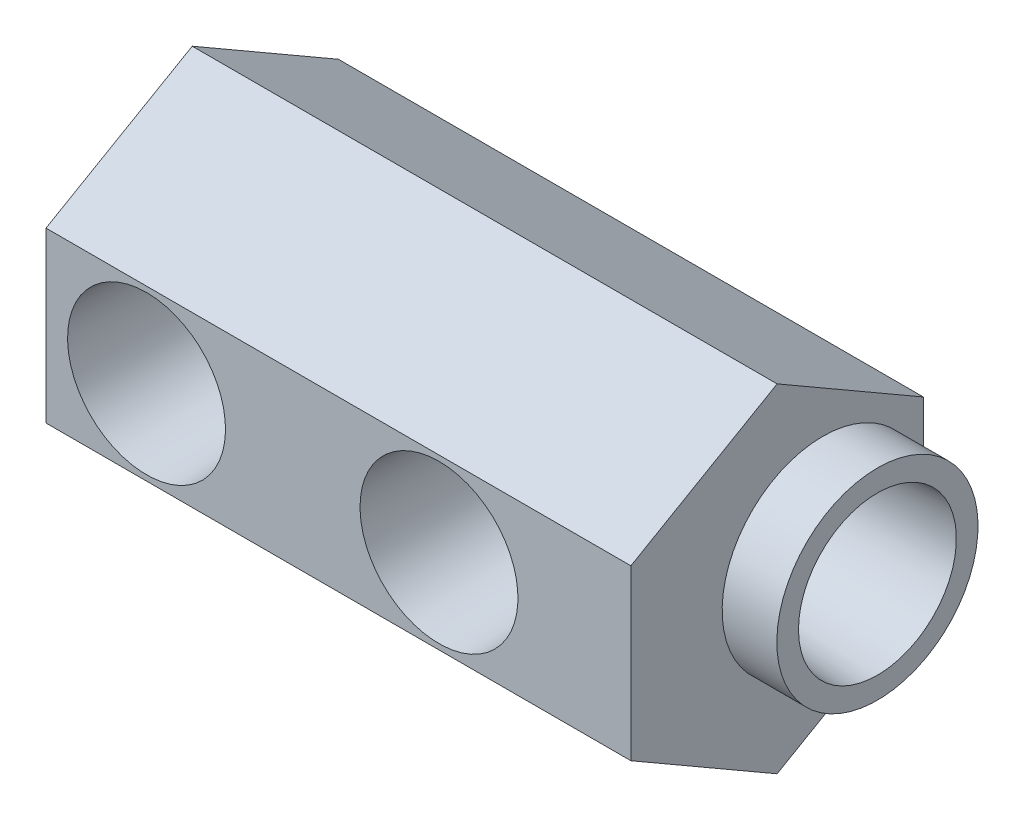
ISO-10303-21;
HEADER;
FILE_DESCRIPTION(('STEP AP214'),'2;1');
FILE_NAME('part.step','',(''),(''),'','','');
FILE_SCHEMA(('AUTOMOTIVE_DESIGN { 1 0 10303 214 1 1 1 1 }'));
ENDSEC;
DATA;
#1=APPLICATION_CONTEXT('core data for automotive mechanical design processes');
#2=APPLICATION_PROTOCOL_DEFINITION('international standard','automotive_design',2000,#1);
#3=PRODUCT_CONTEXT('',#1,'mechanical');
#4=PRODUCT('Part','Part','',(#3));
#5=PRODUCT_RELATED_PRODUCT_CATEGORY('part','',(#4));
#6=PRODUCT_DEFINITION_FORMATION('','',#4);
#7=PRODUCT_DEFINITION_CONTEXT('part definition',#1,'design');
#8=PRODUCT_DEFINITION('design','',#6,#7);
#9=PRODUCT_DEFINITION_SHAPE('','',#8);
#10=(LENGTH_UNIT() NAMED_UNIT(*) SI_UNIT(.MILLI.,.METRE.));
#11=(NAMED_UNIT(*) PLANE_ANGLE_UNIT() SI_UNIT($,.RADIAN.));
#12=(NAMED_UNIT(*) SI_UNIT($,.STERADIAN.) SOLID_ANGLE_UNIT());
#13=UNCERTAINTY_MEASURE_WITH_UNIT(LENGTH_MEASURE(1.E-05),#10,'distance_accuracy_value','');
#14=(GEOMETRIC_REPRESENTATION_CONTEXT(3) GLOBAL_UNCERTAINTY_ASSIGNED_CONTEXT((#13)) GLOBAL_UNIT_ASSIGNED_CONTEXT((#10,
#11,#12)) REPRESENTATION_CONTEXT('',''));
#15=CARTESIAN_POINT('',(0.,0.,0.));
#16=DIRECTION('',(0.,0.,1.));
#17=DIRECTION('',(1.,0.,0.));
#18=AXIS2_PLACEMENT_3D('',#15,#16,#17);
#19=CARTESIAN_POINT('',(34.13125,0.,40.9631300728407));
#20=DIRECTION('',(0.,0.,-1.));
#21=DIRECTION('',(-1.,0.,0.));
#22=AXIS2_PLACEMENT_3D('',#19,#20,#21);
#23=CYLINDRICAL_SURFACE('',#22,5.55625);
#24=CARTESIAN_POINT('',(34.13125,0.,13.2293295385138));
#25=DIRECTION('',(0.,0.,-1.));
#26=DIRECTION('',(-1.,0.,0.));
#27=AXIS2_PLACEMENT_3D('',#24,#25,#26);
#28=CIRCLE('',#27,5.55625);
#29=CARTESIAN_POINT('',(39.5789346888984,-1.09299844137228,13.2293295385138));
#30=VERTEX_POINT('',#29);
#31=CARTESIAN_POINT('',(39.5789346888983,1.09299844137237,13.2293295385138));
#32=VERTEX_POINT('',#31);
#33=EDGE_CURVE('E218',#30,#32,#28,.T.);
#34=ORIENTED_EDGE('',*,*,#33,.F.);
#35=CARTESIAN_POINT('',(39.5789346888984,-1.09299844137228,13.2293295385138));
#36=CARTESIAN_POINT('',(39.5544490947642,-1.21516001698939,13.1996233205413));
#37=CARTESIAN_POINT('',(39.526051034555,-1.33528320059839,13.165096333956));
#38=CARTESIAN_POINT('',(39.4623011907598,-1.57053002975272,13.0871970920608));
#39=CARTESIAN_POINT('',(39.4269593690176,-1.68566055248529,13.0438375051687));
#40=CARTESIAN_POINT('',(39.3504799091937,-1.90929550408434,12.9494263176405));
#41=CARTESIAN_POINT('',(39.3093998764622,-2.0178520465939,12.8984508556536));
#42=CARTESIAN_POINT('',(39.2220503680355,-2.22906649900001,12.7892275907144));
#43=CARTESIAN_POINT('',(39.1757790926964,-2.33172234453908,12.730977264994));
#44=CARTESIAN_POINT('',(39.0310359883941,-2.62913921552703,12.5470627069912));
#45=CARTESIAN_POINT('',(38.9261141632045,-2.81481546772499,12.4116016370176));
#46=CARTESIAN_POINT('',(38.7052468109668,-3.1611447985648,12.1183144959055));
#47=CARTESIAN_POINT('',(38.5892632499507,-3.32170613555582,11.9604102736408));
#48=CARTESIAN_POINT('',(38.4011625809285,-3.55701756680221,11.6931838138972));
#49=CARTESIAN_POINT('',(38.3303586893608,-3.64013654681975,11.5901730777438));
#50=CARTESIAN_POINT('',(38.1887783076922,-3.79730936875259,11.3773413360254));
#51=CARTESIAN_POINT('',(38.1180018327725,-3.87136040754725,11.2675182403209));
#52=CARTESIAN_POINT('',(37.978364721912,-4.01014903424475,11.0412030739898));
#53=CARTESIAN_POINT('',(37.9095018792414,-4.07489774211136,10.9247192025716));
#54=CARTESIAN_POINT('',(37.7758663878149,-4.19484729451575,10.6847807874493));
#55=CARTESIAN_POINT('',(37.711091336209,-4.25005378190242,10.5613304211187));
#56=CARTESIAN_POINT('',(37.5766425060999,-4.36005463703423,10.2825268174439));
#57=CARTESIAN_POINT('',(37.5084229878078,-4.41272723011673,10.1256045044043));
#58=CARTESIAN_POINT('',(37.3886191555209,-4.50189596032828,9.8012507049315));
#59=CARTESIAN_POINT('',(37.3369972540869,-4.53842871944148,9.63384400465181));
#60=CARTESIAN_POINT('',(37.2646488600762,-4.58861485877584,9.31749013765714));
#61=CARTESIAN_POINT('',(37.2403188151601,-4.60497954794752,9.16983109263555));
#62=CARTESIAN_POINT('',(37.2130840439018,-4.62325852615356,8.87170940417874));
#63=CARTESIAN_POINT('',(37.2101544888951,-4.6251895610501,8.7212502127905));
#64=CARTESIAN_POINT('',(37.2262054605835,-4.6144592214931,8.42227270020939));
#65=CARTESIAN_POINT('',(37.2451629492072,-4.60181319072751,8.27375250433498));
#66=CARTESIAN_POINT('',(37.301722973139,-4.56301903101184,7.9820337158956));
#67=CARTESIAN_POINT('',(37.3393586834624,-4.53684687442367,7.83884508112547));
#68=CARTESIAN_POINT('',(37.4188063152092,-4.47947928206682,7.5899141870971));
#69=CARTESIAN_POINT('',(37.4579718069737,-4.45058072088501,7.48275033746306));
#70=CARTESIAN_POINT('',(37.5426121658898,-4.3860408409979,7.2730308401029));
#71=CARTESIAN_POINT('',(37.5880891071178,-4.35039730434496,7.17047672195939));
#72=CARTESIAN_POINT('',(37.6836495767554,-4.27272448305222,6.96962355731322));
#73=CARTESIAN_POINT('',(37.7337474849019,-4.23067498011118,6.87133929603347));
#74=CARTESIAN_POINT('',(37.8369257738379,-4.14060090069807,6.67921301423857));
#75=CARTESIAN_POINT('',(37.8900059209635,-4.09257679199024,6.58537064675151));
#76=CARTESIAN_POINT('',(38.0194613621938,-3.97045074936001,6.36540015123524));
#77=CARTESIAN_POINT('',(38.0966927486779,-3.89358171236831,6.24130355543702));
#78=CARTESIAN_POINT('',(38.2520491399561,-3.72877674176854,6.00123259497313));
#79=CARTESIAN_POINT('',(38.3301744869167,-3.64083643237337,5.88526147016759));
#80=CARTESIAN_POINT('',(38.4850772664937,-3.45409793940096,5.661783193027));
#81=CARTESIAN_POINT('',(38.5618565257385,-3.35531604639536,5.55426374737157));
#82=CARTESIAN_POINT('',(38.7122992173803,-3.14681568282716,5.34800674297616));
#83=CARTESIAN_POINT('',(38.7859623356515,-3.03709611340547,5.24927006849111));
#84=CARTESIAN_POINT('',(38.9671178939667,-2.74407311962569,5.01027255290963));
#85=CARTESIAN_POINT('',(39.0712582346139,-2.55316626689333,4.87657923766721));
#86=CARTESIAN_POINT('',(39.2609902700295,-2.14660197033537,4.63662991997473));
#87=CARTESIAN_POINT('',(39.3466058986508,-1.93097702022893,4.53033847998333));
#88=CARTESIAN_POINT('',(39.4806651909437,-1.51500653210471,4.36535535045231));
#89=CARTESIAN_POINT('',(39.5328898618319,-1.31787986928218,4.3017335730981));
#90=CARTESIAN_POINT('',(39.5951234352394,-1.01425724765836,4.2262285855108));
#91=CARTESIAN_POINT('',(39.6131795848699,-0.911775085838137,4.20438684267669));
#92=CARTESIAN_POINT('',(39.6436127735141,-0.704761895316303,4.16763088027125));
#93=CARTESIAN_POINT('',(39.6559925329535,-0.60023187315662,4.15271334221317));
#94=CARTESIAN_POINT('',(39.6725213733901,-0.415469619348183,4.13281151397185));
#95=CARTESIAN_POINT('',(39.6779398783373,-0.335509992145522,4.12629384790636));
#96=CARTESIAN_POINT('',(39.6853157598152,-0.175254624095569,4.11742529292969));
#97=CARTESIAN_POINT('',(39.687275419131,-0.0949591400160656,4.11507165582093));
#98=CARTESIAN_POINT('',(39.6874807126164,-0.0146400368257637,4.11482318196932));
#99=B_SPLINE_CURVE_WITH_KNOTS('',3,(#35,#36,#37,#38,#39,#40,#41,#42,#43,#44,#45,#46,#47,#48,#49,
#50,#51,#52,#53,#54,#55,#56,#57,#58,#59,#60,#61,#62,#63,#64,#65,#66,#67,#68,#69,#70,#71,#72,#73,
#74,#75,#76,#77,#78,#79,#80,#81,#82,#83,#84,#85,#86,#87,#88,#89,#90,#91,#92,#93,#94,#95,#96,#97,
#98),.UNSPECIFIED.,.F.,.F.,(4,2,2,2,2,2,2,2,2,2,2,2,2,2,2,2,2,2,2,2,2,2,2,2,2,2,2,2,2,2,2,4),
(0.,0.383972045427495,0.767397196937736,1.14721804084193,1.52717096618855,2.28209770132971,
3.03972074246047,3.48967761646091,3.93977323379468,4.38932625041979,4.83861250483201,
5.37431782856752,5.90880129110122,6.35844070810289,6.80755837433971,7.25620373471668,
7.70564881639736,8.05826835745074,8.41100405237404,8.76487703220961,9.1187223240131,
9.61353357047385,10.1085410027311,10.6028145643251,11.0971378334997,11.8598992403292,
12.621669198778,13.259541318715,13.5781932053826,13.8966922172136,14.1377410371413,
14.3786307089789),.UNSPECIFIED.);
#100=CARTESIAN_POINT('',(39.6874807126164,-0.0146400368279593,4.11482318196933));
#101=VERTEX_POINT('',#100);
#102=EDGE_CURVE('E119',#30,#101,#99,.T.);
#103=ORIENTED_EDGE('',*,*,#102,.T.);
#104=CARTESIAN_POINT('',(34.13125,0.,4.11482318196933));
#105=DIRECTION('',(0.,0.,-1.));
#106=DIRECTION('',(-1.,0.,0.));
#107=AXIS2_PLACEMENT_3D('',#104,#105,#106);
#108=CIRCLE('',#107,5.55625);
#109=CARTESIAN_POINT('',(39.6874807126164,0.0146400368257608,4.11482318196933));
#110=VERTEX_POINT('',#109);
#111=EDGE_CURVE('E118',#101,#110,#108,.T.);
#112=ORIENTED_EDGE('',*,*,#111,.T.);
#113=CARTESIAN_POINT('',(39.6874807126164,0.0146400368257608,4.11482318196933));
#114=CARTESIAN_POINT('',(39.6872164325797,0.12520901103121,4.11514743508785));
#115=CARTESIAN_POINT('',(39.6835988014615,0.235738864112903,4.11948915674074));
#116=CARTESIAN_POINT('',(39.6698672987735,0.45572865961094,4.13600411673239));
#117=CARTESIAN_POINT('',(39.6597580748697,0.565189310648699,4.14817175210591));
#118=CARTESIAN_POINT('',(39.6333550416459,0.781373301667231,4.18001294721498));
#119=CARTESIAN_POINT('',(39.6171095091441,0.888111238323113,4.19962792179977));
#120=CARTESIAN_POINT('',(39.5787901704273,1.09895385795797,4.2460265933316));
#121=CARTESIAN_POINT('',(39.5567156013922,1.20305819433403,4.27281122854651));
#122=CARTESIAN_POINT('',(39.5072522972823,1.40767878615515,4.33304990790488));
#123=CARTESIAN_POINT('',(39.4798788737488,1.50820441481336,4.36648474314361));
#124=CARTESIAN_POINT('',(39.4202852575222,1.70547853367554,4.4396114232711));
#125=CARTESIAN_POINT('',(39.388063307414,1.80222563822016,4.47930553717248));
#126=CARTESIAN_POINT('',(39.2848077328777,2.08646789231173,4.60721468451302));
#127=CARTESIAN_POINT('',(39.2072327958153,2.26777004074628,4.70419822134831));
#128=CARTESIAN_POINT('',(39.065807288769,2.55719827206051,4.88399854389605));
#129=CARTESIAN_POINT('',(39.0053532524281,2.67035899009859,4.96162484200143));
#130=CARTESIAN_POINT('',(38.8797717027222,2.88776526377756,5.12518060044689));
#131=CARTESIAN_POINT('',(38.8146441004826,2.99201064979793,5.21111021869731));
#132=CARTESIAN_POINT('',(38.680912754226,3.19170324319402,5.39074983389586));
#133=CARTESIAN_POINT('',(38.6123005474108,3.28712727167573,5.48447916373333));
#134=CARTESIAN_POINT('',(38.4731350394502,3.46886739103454,5.67901302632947));
#135=CARTESIAN_POINT('',(38.4025819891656,3.55518465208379,5.77981664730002));
#136=CARTESIAN_POINT('',(38.2596877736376,3.72022104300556,5.99015789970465));
#137=CARTESIAN_POINT('',(38.1873376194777,3.79877079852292,6.09982226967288));
#138=CARTESIAN_POINT('',(38.0438836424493,3.94636559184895,6.32622120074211));
#139=CARTESIAN_POINT('',(37.972780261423,4.01540731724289,6.44295820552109));
#140=CARTESIAN_POINT('',(37.8342032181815,4.14354024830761,6.68336905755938));
#141=CARTESIAN_POINT('',(37.7667207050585,4.20265654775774,6.80702432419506));
#142=CARTESIAN_POINT('',(37.6380794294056,4.3105805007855,7.06180432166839));
#143=CARTESIAN_POINT('',(37.5769150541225,4.35939734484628,7.19292225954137));
#144=CARTESIAN_POINT('',(37.4596950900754,4.44963912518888,7.4747610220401));
#145=CARTESIAN_POINT('',(37.4045439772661,4.49005443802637,7.62619546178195));
#146=CARTESIAN_POINT('',(37.3124140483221,4.55580801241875,7.9375933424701));
#147=CARTESIAN_POINT('',(37.2753902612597,4.58118361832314,8.09753457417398));
#148=CARTESIAN_POINT('',(37.2378696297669,4.60662997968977,8.34246626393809));
#149=CARTESIAN_POINT('',(37.2283635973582,4.61300867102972,8.42548461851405));
#150=CARTESIAN_POINT('',(37.2160298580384,4.62126713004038,8.59225522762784));
#151=CARTESIAN_POINT('',(37.2132015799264,4.62314728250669,8.67600741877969));
#152=CARTESIAN_POINT('',(37.2144013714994,4.62234685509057,8.84343635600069));
#153=CARTESIAN_POINT('',(37.2184293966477,4.61966630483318,8.92711310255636));
#154=CARTESIAN_POINT('',(37.2331072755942,4.60982346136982,9.09364901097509));
#155=CARTESIAN_POINT('',(37.2437605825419,4.60265883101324,9.17650772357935));
#156=CARTESIAN_POINT('',(37.2724955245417,4.58310151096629,9.34892771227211));
#157=CARTESIAN_POINT('',(37.291213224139,4.57025783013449,9.43833109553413));
#158=CARTESIAN_POINT('',(37.3349540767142,4.53970346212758,9.61475503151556));
#159=CARTESIAN_POINT('',(37.3599817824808,4.5219892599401,9.70177381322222));
#160=CARTESIAN_POINT('',(37.4429334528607,4.46198286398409,9.95909772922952));
#161=CARTESIAN_POINT('',(37.5086625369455,4.4128670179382,10.1253355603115));
#162=CARTESIAN_POINT('',(37.6377651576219,4.31063808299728,10.4129990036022));
#163=CARTESIAN_POINT('',(37.6988233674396,4.2604437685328,10.5365906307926));
#164=CARTESIAN_POINT('',(37.8258950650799,4.15072973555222,10.7770048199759));
#165=CARTESIAN_POINT('',(37.8919113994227,4.09120463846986,10.8938234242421));
#166=CARTESIAN_POINT('',(38.0266588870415,3.96312612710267,11.121076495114));
#167=CARTESIAN_POINT('',(38.0953949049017,3.89455597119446,11.2314985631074));
#168=CARTESIAN_POINT('',(38.2336323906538,3.74866283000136,11.4458476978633));
#169=CARTESIAN_POINT('',(38.3031337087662,3.67134153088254,11.5497760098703));
#170=CARTESIAN_POINT('',(38.4448682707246,3.50388957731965,11.7561375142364));
#171=CARTESIAN_POINT('',(38.5170635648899,3.41331080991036,11.8582338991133));
#172=CARTESIAN_POINT('',(38.6590844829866,3.22254141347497,12.0548682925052));
#173=CARTESIAN_POINT('',(38.7289098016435,3.12234955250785,12.1494053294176));
#174=CARTESIAN_POINT('',(38.8644021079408,2.91284768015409,12.3299016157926));
#175=CARTESIAN_POINT('',(38.9300859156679,2.80357937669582,12.4158965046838));
#176=CARTESIAN_POINT('',(39.0561481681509,2.57570047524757,12.5789090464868));
#177=CARTESIAN_POINT('',(39.1165285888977,2.45709338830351,12.6559300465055));
#178=CARTESIAN_POINT('',(39.2167835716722,2.24050830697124,12.7826131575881));
#179=CARTESIAN_POINT('',(39.2580964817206,2.14443308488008,12.8343991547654));
#180=CARTESIAN_POINT('',(39.3361358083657,1.94738364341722,12.9316485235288));
#181=CARTESIAN_POINT('',(39.3728642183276,1.84641157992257,12.9771146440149));
#182=CARTESIAN_POINT('',(39.4413614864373,1.6390928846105,13.0615179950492));
#183=CARTESIAN_POINT('',(39.4730882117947,1.53270964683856,13.1003999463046));
#184=CARTESIAN_POINT('',(39.5306270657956,1.3157900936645,13.1706609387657));
#185=CARTESIAN_POINT('',(39.5564315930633,1.20524865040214,13.2020303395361));
#186=CARTESIAN_POINT('',(39.5789346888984,1.09299844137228,13.2293295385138));
#187=B_SPLINE_CURVE_WITH_KNOTS('',3,(#113,#114,#115,#116,#117,#118,#119,#120,#121,#122,#123,
#124,#125,#126,#127,#128,#129,#130,#131,#132,#133,#134,#135,#136,#137,#138,#139,#140,#141,#142,
#143,#144,#145,#146,#147,#148,#149,#150,#151,#152,#153,#154,#155,#156,#157,#158,#159,#160,#161,
#162,#163,#164,#165,#166,#167,#168,#169,#170,#171,#172,#173,#174,#175,#176,#177,#178,#179,#180,
#181,#182,#183,#184,#185,#186),.UNSPECIFIED.,.F.,.F.,(4,2,2,2,2,2,2,2,2,2,2,2,2,2,2,2,2,2,2,2,2,
2,2,2,2,2,2,2,2,2,2,2,2,2,2,2,4),(0.,0.331559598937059,0.662882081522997,0.991650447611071,
1.320461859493,1.64833695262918,1.97633117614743,2.63293764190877,3.08229638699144,
3.53166367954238,3.98218002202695,4.43263840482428,4.89139964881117,5.35032031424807,
5.8080626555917,6.26539479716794,6.76242936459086,7.25822454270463,7.50929779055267,
7.76034956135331,8.01139970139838,8.26258080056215,8.53886885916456,8.81535683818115,
9.36934945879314,9.80896693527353,10.2488387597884,10.6895364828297,11.1301494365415,
11.5928755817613,12.0556611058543,12.5164266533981,12.9770197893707,13.3267921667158,
13.6764119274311,14.0288353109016,14.3817085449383),.UNSPECIFIED.);
#188=EDGE_CURVE('E234',#110,#32,#187,.T.);
#189=ORIENTED_EDGE('',*,*,#188,.T.);
#190=EDGE_LOOP('',(#34,#103,#112,#189));
#191=FACE_BOUND('',#190,.T.);
#192=CARTESIAN_POINT('',(28.575,0.,12.0523));
#193=CARTESIAN_POINT('',(28.5750006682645,-0.0848998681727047,12.0522992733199));
#194=CARTESIAN_POINT('',(28.5769510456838,-0.169823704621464,12.0490328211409));
#195=CARTESIAN_POINT('',(28.5847055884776,-0.339030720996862,12.036009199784));
#196=CARTESIAN_POINT('',(28.5905120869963,-0.423313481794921,12.0262481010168));
#197=CARTESIAN_POINT('',(28.6058509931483,-0.590722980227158,12.000339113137));
#198=CARTESIAN_POINT('',(28.6153906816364,-0.67384712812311,11.9841787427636));
#199=CARTESIAN_POINT('',(28.6379575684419,-0.838182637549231,11.9456870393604));
#200=CARTESIAN_POINT('',(28.6509862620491,-0.919393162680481,11.9233530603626));
#201=CARTESIAN_POINT('',(28.6947128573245,-1.15846258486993,11.8477406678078));
#202=CARTESIAN_POINT('',(28.7301508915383,-1.31278558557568,11.7856889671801));
#203=CARTESIAN_POINT('',(28.8106373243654,-1.60826775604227,11.6406782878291));
#204=CARTESIAN_POINT('',(28.8556831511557,-1.74943043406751,11.5577249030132));
#205=CARTESIAN_POINT('',(28.955617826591,-2.02683861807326,11.3662260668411));
#206=CARTESIAN_POINT('',(29.0109945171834,-2.16189544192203,11.2562149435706));
#207=CARTESIAN_POINT('',(29.1243221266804,-2.41279729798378,11.0170191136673));
#208=CARTESIAN_POINT('',(29.1822762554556,-2.52861747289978,10.8878100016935));
#209=CARTESIAN_POINT('',(29.3025287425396,-2.75196381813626,10.5954878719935));
#210=CARTESIAN_POINT('',(29.3645052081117,-2.85679430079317,10.4301644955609));
#211=CARTESIAN_POINT('',(29.4770924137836,-3.03678309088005,10.0806063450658));
#212=CARTESIAN_POINT('',(29.5277214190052,-3.11198923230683,9.89640266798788));
#213=CARTESIAN_POINT('',(29.599195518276,-3.2148628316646,9.55924527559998));
#214=CARTESIAN_POINT('',(29.6242672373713,-3.24959670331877,9.40934725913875));
#215=CARTESIAN_POINT('',(29.6595037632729,-3.29792815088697,9.10453594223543));
#216=CARTESIAN_POINT('',(29.6696867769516,-3.31155154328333,8.94962900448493));
#217=CARTESIAN_POINT('',(29.6736449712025,-3.31687918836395,8.6389309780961));
#218=CARTESIAN_POINT('',(29.6673892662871,-3.30854218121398,8.48313877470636));
#219=CARTESIAN_POINT('',(29.63936851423,-3.27038915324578,8.17560124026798));
#220=CARTESIAN_POINT('',(29.6175919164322,-3.24055713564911,8.0238590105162));
#221=CARTESIAN_POINT('',(29.5618558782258,-3.16145974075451,7.72996747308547));
#222=CARTESIAN_POINT('',(29.5280420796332,-3.1124260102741,7.58772664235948));
#223=CARTESIAN_POINT('',(29.4518900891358,-2.99671392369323,7.31310864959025));
#224=CARTESIAN_POINT('',(29.4095487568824,-2.93002906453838,7.18073514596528));
#225=CARTESIAN_POINT('',(29.3122487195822,-2.76759060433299,6.90525821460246));
#226=CARTESIAN_POINT('',(29.2563746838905,-2.66880321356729,6.76426446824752));
#227=CARTESIAN_POINT('',(29.1432867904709,-2.45096949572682,6.49941895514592));
#228=CARTESIAN_POINT('',(29.0860717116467,-2.33190403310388,6.37558358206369));
#229=CARTESIAN_POINT('',(28.9675359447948,-2.05745912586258,6.13142170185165));
#230=CARTESIAN_POINT('',(28.9067162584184,-1.89934283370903,6.01386647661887));
#231=CARTESIAN_POINT('',(28.8238182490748,-1.64651433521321,5.85905395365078));
#232=CARTESIAN_POINT('',(28.7975645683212,-1.55958796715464,5.81102030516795));
#233=CARTESIAN_POINT('',(28.7485626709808,-1.38099210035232,5.72263669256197));
#234=CARTESIAN_POINT('',(28.7258123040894,-1.28932555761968,5.68228201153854));
#235=CARTESIAN_POINT('',(28.6858212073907,-1.10783713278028,5.61209316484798));
#236=CARTESIAN_POINT('',(28.6683225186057,-1.01826711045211,5.58175401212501));
#237=CARTESIAN_POINT('',(28.6375136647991,-0.836233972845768,5.52871739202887));
#238=CARTESIAN_POINT('',(28.6242011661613,-0.743772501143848,5.50601566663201));
#239=CARTESIAN_POINT('',(28.6021656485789,-0.556773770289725,5.46860560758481));
#240=CARTESIAN_POINT('',(28.5934393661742,-0.46223803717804,5.45389158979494));
#241=CARTESIAN_POINT('',(28.5808395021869,-0.271933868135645,5.43268670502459));
#242=CARTESIAN_POINT('',(28.5769652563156,-0.176165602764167,5.42619471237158));
#243=CARTESIAN_POINT('',(28.5743804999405,0.00274738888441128,5.42186133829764));
#244=CARTESIAN_POINT('',(28.5750460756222,0.085859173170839,5.4229747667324));
#245=CARTESIAN_POINT('',(28.58008086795,0.251661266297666,5.43142284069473));
#246=CARTESIAN_POINT('',(28.5844512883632,0.33435142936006,5.43875950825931));
#247=CARTESIAN_POINT('',(28.6029933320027,0.580774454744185,5.469991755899));
#248=CARTESIAN_POINT('',(28.6225933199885,0.743049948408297,5.50310528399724));
#249=CARTESIAN_POINT('',(28.6738849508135,1.05529159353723,5.59127014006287));
#250=CARTESIAN_POINT('',(28.7052949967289,1.20545240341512,5.64581180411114));
#251=CARTESIAN_POINT('',(28.7776912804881,1.49449947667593,5.7747037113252));
#252=CARTESIAN_POINT('',(28.8186794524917,1.63338345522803,5.84905795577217));
#253=CARTESIAN_POINT('',(28.9118880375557,1.91150931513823,6.02409363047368));
#254=CARTESIAN_POINT('',(28.9648331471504,2.04928760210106,6.12670835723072));
#255=CARTESIAN_POINT('',(29.0745139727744,2.30671992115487,6.3510780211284));
#256=CARTESIAN_POINT('',(29.1312540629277,2.42635250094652,6.47285527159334));
#257=CARTESIAN_POINT('',(29.2510439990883,2.65985525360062,6.7502963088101));
#258=CARTESIAN_POINT('',(29.3139707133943,2.77102268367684,6.90830275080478));
#259=CARTESIAN_POINT('',(29.4310403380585,2.9652705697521,7.24366324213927));
#260=CARTESIAN_POINT('',(29.4851928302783,3.04838177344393,7.42099582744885));
#261=CARTESIAN_POINT('',(29.566443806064,3.16836543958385,7.75141976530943));
#262=CARTESIAN_POINT('',(29.5968598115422,3.21134894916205,7.90146793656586));
#263=CARTESIAN_POINT('',(29.6432564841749,3.27588840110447,8.2081933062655));
#264=CARTESIAN_POINT('',(29.6592567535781,3.29747344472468,8.36486119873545));
#265=CARTESIAN_POINT('',(29.6744709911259,3.31801462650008,8.68108111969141));
#266=CARTESIAN_POINT('',(29.6736258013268,3.31689101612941,8.84064134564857));
#267=CARTESIAN_POINT('',(29.6551364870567,3.29189001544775,9.15701215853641));
#268=CARTESIAN_POINT('',(29.6374829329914,3.26799985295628,9.31382115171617));
#269=CARTESIAN_POINT('',(29.5891365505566,3.20042554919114,9.61343308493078));
#270=CARTESIAN_POINT('',(29.5590535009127,3.15766140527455,9.75654873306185));
#271=CARTESIAN_POINT('',(29.4894202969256,3.05437348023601,10.033725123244));
#272=CARTESIAN_POINT('',(29.4498665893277,2.99384303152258,10.1677824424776));
#273=CARTESIAN_POINT('',(29.3583349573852,2.846023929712,10.4451565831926));
#274=CARTESIAN_POINT('',(29.3053817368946,2.75604928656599,10.5867170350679));
#275=CARTESIAN_POINT('',(29.1967344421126,2.55644202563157,10.8541330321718));
#276=CARTESIAN_POINT('',(29.1410381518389,2.44679331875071,10.979975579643));
#277=CARTESIAN_POINT('',(29.0227845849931,2.19053379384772,11.2328232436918));
#278=CARTESIAN_POINT('',(28.96053876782,2.04081916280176,11.3568522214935));
#279=CARTESIAN_POINT('',(28.8449658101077,1.71935409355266,11.5782050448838));
#280=CARTESIAN_POINT('',(28.7916416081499,1.54759642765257,11.6755200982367));
#281=CARTESIAN_POINT('',(28.7236500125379,1.27982168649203,11.7967671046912));
#282=CARTESIAN_POINT('',(28.7032416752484,1.1905040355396,11.8326406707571));
#283=CARTESIAN_POINT('',(28.6664781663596,1.0083585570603,11.8966737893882));
#284=CARTESIAN_POINT('',(28.6501206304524,0.915532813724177,11.9248378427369));
#285=CARTESIAN_POINT('',(28.6220008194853,0.727402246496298,11.9729557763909));
#286=CARTESIAN_POINT('',(28.6102250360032,0.632105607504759,11.9929338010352));
#287=CARTESIAN_POINT('',(28.5915844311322,0.439706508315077,12.0244495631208));
#288=CARTESIAN_POINT('',(28.5847154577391,0.342605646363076,12.0359944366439));
#289=CARTESIAN_POINT('',(28.5786090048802,0.204357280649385,12.0462474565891));
#290=CARTESIAN_POINT('',(28.5772566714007,0.163533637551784,12.0485160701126));
#291=CARTESIAN_POINT('',(28.5754519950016,0.0818085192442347,12.0515425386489));
#292=CARTESIAN_POINT('',(28.5749996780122,0.0409070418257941,12.052300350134));
#293=CARTESIAN_POINT('',(28.575,0.,12.0523));
#294=B_SPLINE_CURVE_WITH_KNOTS('',3,(#192,#193,#194,#195,#196,#197,#198,#199,#200,#201,#202,
#203,#204,#205,#206,#207,#208,#209,#210,#211,#212,#213,#214,#215,#216,#217,#218,#219,#220,#221,
#222,#223,#224,#225,#226,#227,#228,#229,#230,#231,#232,#233,#234,#235,#236,#237,#238,#239,#240,
#241,#242,#243,#244,#245,#246,#247,#248,#249,#250,#251,#252,#253,#254,#255,#256,#257,#258,#259,
#260,#261,#262,#263,#264,#265,#266,#267,#268,#269,#270,#271,#272,#273,#274,#275,#276,#277,#278,
#279,#280,#281,#282,#283,#284,#285,#286,#287,#288,#289,#290,#291,#292,#293),.UNSPECIFIED.,.T.,
.F.,(4,2,2,2,2,2,2,2,2,2,2,2,2,2,2,2,2,2,2,2,2,2,2,2,2,2,2,2,2,2,2,2,2,2,2,2,2,2,2,2,2,2,2,2,2,
2,2,2,2,2,4),(0.,0.254656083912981,0.509466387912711,0.764776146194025,1.02019549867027,
1.52794272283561,2.03555420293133,2.58173686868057,3.12861990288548,3.74162141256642,
4.35362901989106,4.81933942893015,5.28447985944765,5.75049483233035,6.2168569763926,
6.67775821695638,7.13882950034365,7.67972067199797,8.22112511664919,8.83621320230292,
9.14402495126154,9.45164700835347,9.73975475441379,10.0277016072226,10.3154432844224,
10.6031455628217,10.852188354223,11.1013120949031,11.5989968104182,12.0854984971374,
12.5720985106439,13.1092818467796,13.6470953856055,14.2538243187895,14.8598861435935,
15.3349731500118,15.8094131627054,16.2855196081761,16.7618933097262,17.2172454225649,
17.6727686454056,18.1984855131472,18.7246342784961,19.3341634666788,19.9438930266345,
20.2387017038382,20.5333379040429,20.827098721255,21.1206106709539,21.243307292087,
21.3660074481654),.UNSPECIFIED.);
#295=CARTESIAN_POINT('',(28.575,0.,12.0523));
#296=VERTEX_POINT('',#295);
#297=EDGE_CURVE('E124',#296,#296,#294,.T.);
#298=ORIENTED_EDGE('',*,*,#297,.F.);
#299=EDGE_LOOP('',(#298));
#300=FACE_BOUND('',#299,.T.);
#301=ADVANCED_FACE('F18',(#191,#300),#23,.F.);
#302=CARTESIAN_POINT('',(16.1798001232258,0.,4.99248500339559));
#303=DIRECTION('',(1.,0.,0.));
#304=DIRECTION('',(0.,0.,-1.));
#305=AXIS2_PLACEMENT_3D('',#302,#303,#304);
#306=PLANE('',#305);
#307=CARTESIAN_POINT('',(16.1798001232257,0.,8.7376));
#308=DIRECTION('',(-1.,0.,0.));
#309=DIRECTION('',(0.,0.,1.));
#310=AXIS2_PLACEMENT_3D('',#307,#308,#309);
#311=CIRCLE('',#310,2.92102318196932);
#312=CARTESIAN_POINT('',(16.1798001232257,0.,11.6586231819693));
#313=VERTEX_POINT('',#312);
#314=EDGE_CURVE('E362',#313,#313,#311,.T.);
#315=ORIENTED_EDGE('',*,*,#314,.T.);
#316=EDGE_LOOP('',(#315));
#317=FACE_BOUND('',#316,.T.);
#318=CARTESIAN_POINT('',(16.1798001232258,0.,8.7376));
#319=DIRECTION('',(1.,0.,0.));
#320=DIRECTION('',(0.,0.,-1.));
#321=AXIS2_PLACEMENT_3D('',#318,#319,#320);
#322=CIRCLE('',#321,3.3147);
#323=CARTESIAN_POINT('',(16.1798001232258,0.,5.4229));
#324=VERTEX_POINT('',#323);
#325=EDGE_CURVE('E22',#324,#324,#322,.T.);
#326=ORIENTED_EDGE('',*,*,#325,.T.);
#327=EDGE_LOOP('',(#326));
#328=FACE_BOUND('',#327,.T.);
#329=ADVANCED_FACE('F20',(#317,#328),#306,.T.);
#330=CARTESIAN_POINT('',(55.5498,0.,8.7376));
#331=DIRECTION('',(-1.,0.,0.));
#332=DIRECTION('',(0.,0.,1.));
#333=AXIS2_PLACEMENT_3D('',#330,#331,#332);
#334=PLANE('',#333);
#335=CARTESIAN_POINT('',(55.5498,0.,8.7376));
#336=DIRECTION('',(-1.,0.,0.));
#337=DIRECTION('',(0.,1.,0.));
#338=AXIS2_PLACEMENT_3D('',#335,#336,#337);
#339=CIRCLE('',#338,8.7376);
#340=CARTESIAN_POINT('',(55.5498,8.7376,8.7376));
#341=VERTEX_POINT('',#340);
#342=EDGE_CURVE('E294',#341,#341,#339,.T.);
#343=ORIENTED_EDGE('',*,*,#342,.F.);
#344=EDGE_LOOP('',(#343));
#345=FACE_BOUND('',#344,.T.);
#346=CARTESIAN_POINT('',(55.5498,0.,8.7376));
#347=DIRECTION('',(-1.,0.,0.));
#348=DIRECTION('',(0.,0.,1.));
#349=AXIS2_PLACEMENT_3D('',#346,#347,#348);
#350=CIRCLE('',#349,6.85802318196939);
#351=CARTESIAN_POINT('',(55.5498,0.,15.5956231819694));
#352=VERTEX_POINT('',#351);
#353=EDGE_CURVE('E368',#352,#352,#350,.T.);
#354=ORIENTED_EDGE('',*,*,#353,.T.);
#355=EDGE_LOOP('',(#354));
#356=FACE_BOUND('',#355,.T.);
#357=ADVANCED_FACE('F190',(#345,#356),#334,.F.);
#358=CARTESIAN_POINT('',(8.73125,0.,0.751617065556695));
#359=DIRECTION('',(0.,0.,-1.));
#360=DIRECTION('',(-1.,0.,0.));
#361=AXIS2_PLACEMENT_3D('',#358,#359,#360);
#362=CYLINDRICAL_SURFACE('',#361,5.55625);
#363=CARTESIAN_POINT('',(8.73125,0.,13.2293295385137));
#364=DIRECTION('',(0.,0.,-1.));
#365=DIRECTION('',(-1.,0.,0.));
#366=AXIS2_PLACEMENT_3D('',#363,#364,#365);
#367=CIRCLE('',#366,5.55625);
#368=CARTESIAN_POINT('',(3.175,0.,13.2293295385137));
#369=VERTEX_POINT('',#368);
#370=EDGE_CURVE('E283',#369,#369,#367,.T.);
#371=ORIENTED_EDGE('',*,*,#370,.F.);
#372=EDGE_LOOP('',(#371));
#373=FACE_BOUND('',#372,.T.);
#374=CARTESIAN_POINT('',(14.2875,0.,11.6586231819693));
#375=CARTESIAN_POINT('',(14.2874896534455,0.152596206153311,11.6586111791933));
#376=CARTESIAN_POINT('',(14.2811471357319,0.305352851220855,11.6465945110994));
#377=CARTESIAN_POINT('',(14.2563955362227,0.606286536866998,11.5990837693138));
#378=CARTESIAN_POINT('',(14.2379667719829,0.754455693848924,11.5635513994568));
#379=CARTESIAN_POINT('',(14.1909586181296,1.04142033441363,11.4708153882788));
#380=CARTESIAN_POINT('',(14.1624199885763,1.18025083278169,11.4136987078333));
#381=CARTESIAN_POINT('',(14.0977578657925,1.44611723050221,11.2799010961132));
#382=CARTESIAN_POINT('',(14.0616344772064,1.57315329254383,11.2032204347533));
#383=CARTESIAN_POINT('',(13.982303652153,1.82109036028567,11.0268409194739));
#384=CARTESIAN_POINT('',(13.9387887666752,1.9410595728,10.925972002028));
#385=CARTESIAN_POINT('',(13.8504908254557,2.16324055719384,10.7066582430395));
#386=CARTESIAN_POINT('',(13.8057067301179,2.26543725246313,10.5881986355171));
#387=CARTESIAN_POINT('',(13.7153353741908,2.45827606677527,10.3244738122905));
#388=CARTESIAN_POINT('',(13.6700240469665,2.54711079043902,10.1777672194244));
#389=CARTESIAN_POINT('',(13.6092642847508,2.66059008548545,9.94633632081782));
#390=CARTESIAN_POINT('',(13.5902071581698,2.69512914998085,9.86726966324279));
#391=CARTESIAN_POINT('',(13.5552265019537,2.75725124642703,9.70579919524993));
#392=CARTESIAN_POINT('',(13.5393010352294,2.78483858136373,9.62339748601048));
#393=CARTESIAN_POINT('',(13.5121341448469,2.83120816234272,9.46101134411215));
#394=CARTESIAN_POINT('',(13.5006649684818,2.85042741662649,9.38118968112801));
#395=CARTESIAN_POINT('',(13.4815807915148,2.88211974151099,9.21980284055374));
#396=CARTESIAN_POINT('',(13.4739636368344,2.89459658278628,9.13823866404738));
#397=CARTESIAN_POINT('',(13.4629292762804,2.91260026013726,8.97411952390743));
#398=CARTESIAN_POINT('',(13.4595088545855,2.91813241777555,8.89156536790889));
#399=CARTESIAN_POINT('',(13.4570108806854,2.92217297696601,8.72624813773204));
#400=CARTESIAN_POINT('',(13.4579328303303,2.92068218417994,8.64348508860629));
#401=CARTESIAN_POINT('',(13.466352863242,2.90703905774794,8.4185200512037));
#402=CARTESIAN_POINT('',(13.4781425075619,2.88792697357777,8.27682524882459));
#403=CARTESIAN_POINT('',(13.5130659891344,2.8297098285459,7.99915201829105));
#404=CARTESIAN_POINT('',(13.5362041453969,2.79059715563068,7.86317578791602));
#405=CARTESIAN_POINT('',(13.5916565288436,2.69287438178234,7.59681806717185));
#406=CARTESIAN_POINT('',(13.6241676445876,2.63384072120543,7.46663439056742));
#407=CARTESIAN_POINT('',(13.6947461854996,2.49828969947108,7.21737534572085));
#408=CARTESIAN_POINT('',(13.7328160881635,2.42176453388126,7.09830496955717));
#409=CARTESIAN_POINT('',(13.816745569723,2.24074700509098,6.85682529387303));
#410=CARTESIAN_POINT('',(13.8629431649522,2.13382537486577,6.73634759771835));
#411=CARTESIAN_POINT('',(13.953590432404,1.9012266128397,6.51417949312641));
#412=CARTESIAN_POINT('',(13.9980390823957,1.77553871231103,6.41249994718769));
#413=CARTESIAN_POINT('',(14.083218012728,1.50008532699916,6.22535850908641));
#414=CARTESIAN_POINT('',(14.1235977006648,1.3493622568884,6.14113310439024));
#415=CARTESIAN_POINT('',(14.1929742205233,1.03323698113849,5.99995715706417));
#416=CARTESIAN_POINT('',(14.2219809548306,0.867847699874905,5.94298287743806));
#417=CARTESIAN_POINT('',(14.2631394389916,0.542727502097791,5.86300011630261));
#418=CARTESIAN_POINT('',(14.276553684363,0.38378720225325,5.83743593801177));
#419=CARTESIAN_POINT('',(14.2894474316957,0.0633361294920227,5.8128532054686));
#420=CARTESIAN_POINT('',(14.2889346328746,-0.0981731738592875,5.81381998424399));
#421=CARTESIAN_POINT('',(14.2747173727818,-0.404088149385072,5.8409478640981));
#422=CARTESIAN_POINT('',(14.2621723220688,-0.548752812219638,5.86489474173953));
#423=CARTESIAN_POINT('',(14.2267538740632,-0.831675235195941,5.93369322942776));
#424=CARTESIAN_POINT('',(14.2038793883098,-0.969932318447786,5.97854704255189));
#425=CARTESIAN_POINT('',(14.149094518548,-1.2403273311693,6.08885556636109));
#426=CARTESIAN_POINT('',(14.1169652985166,-1.37221377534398,6.15481410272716));
#427=CARTESIAN_POINT('',(14.0466423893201,-1.62344149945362,6.30485449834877));
#428=CARTESIAN_POINT('',(14.0084462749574,-1.74277773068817,6.388943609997));
#429=CARTESIAN_POINT('',(13.9248124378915,-1.97891877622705,6.58306704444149));
#430=CARTESIAN_POINT('',(13.8790359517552,-2.09412511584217,6.69490359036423));
#431=CARTESIAN_POINT('',(13.7881677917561,-2.30492907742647,6.9361023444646));
#432=CARTESIAN_POINT('',(13.7430767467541,-2.40050959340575,7.06547967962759));
#433=CARTESIAN_POINT('',(13.6557324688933,-2.57517665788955,7.34832460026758));
#434=CARTESIAN_POINT('',(13.6138350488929,-2.65285121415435,7.50279459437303));
#435=CARTESIAN_POINT('',(13.5602699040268,-2.74841964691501,7.74457321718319));
#436=CARTESIAN_POINT('',(13.5439608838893,-2.77678645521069,7.82685103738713));
#437=CARTESIAN_POINT('',(13.5151191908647,-2.8261866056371,7.99420307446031));
#438=CARTESIAN_POINT('',(13.5025839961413,-2.84722484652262,8.07927538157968));
#439=CARTESIAN_POINT('',(13.4828953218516,-2.87994941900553,8.24307900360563));
#440=CARTESIAN_POINT('',(13.4753364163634,-2.89234733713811,8.32162029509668));
#441=CARTESIAN_POINT('',(13.4640974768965,-2.91070188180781,8.47969137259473));
#442=CARTESIAN_POINT('',(13.4604153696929,-2.91666195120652,8.55922060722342));
#443=CARTESIAN_POINT('',(13.4570897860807,-2.92204798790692,8.71856620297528));
#444=CARTESIAN_POINT('',(13.4574451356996,-2.92147585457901,8.79838247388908));
#445=CARTESIAN_POINT('',(13.4621667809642,-2.91382109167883,8.95755809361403));
#446=CARTESIAN_POINT('',(13.4665328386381,-2.90673884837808,9.03691746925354));
#447=CARTESIAN_POINT('',(13.4839443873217,-2.87824767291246,9.25505555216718));
#448=CARTESIAN_POINT('',(13.501079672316,-2.85001452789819,9.39268570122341));
#449=CARTESIAN_POINT('',(13.5452382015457,-2.77476023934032,9.66093584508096));
#450=CARTESIAN_POINT('',(13.57226497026,-2.72773239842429,9.79155332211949));
#451=CARTESIAN_POINT('',(13.6352781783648,-2.61284865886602,10.0517219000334));
#452=CARTESIAN_POINT('',(13.6717352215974,-2.54383110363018,10.1806437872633));
#453=CARTESIAN_POINT('',(13.7488608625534,-2.38810346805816,10.4259340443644));
#454=CARTESIAN_POINT('',(13.789531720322,-2.30138386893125,10.5422956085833));
#455=CARTESIAN_POINT('',(13.8772656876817,-2.09863618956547,10.7760458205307));
#456=CARTESIAN_POINT('',(13.9244305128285,-1.98020868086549,10.8913226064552));
#457=CARTESIAN_POINT('',(14.0148356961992,-1.72452153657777,11.1010091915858));
#458=CARTESIAN_POINT('',(14.0580736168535,-1.58725033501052,11.1954060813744));
#459=CARTESIAN_POINT('',(14.1169832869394,-1.36810411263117,11.3198355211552));
#460=CARTESIAN_POINT('',(14.1357898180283,-1.29199681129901,11.3587585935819));
#461=CARTESIAN_POINT('',(14.1706822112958,-1.13615616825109,11.4299693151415));
#462=CARTESIAN_POINT('',(14.1867694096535,-1.05642463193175,11.4622602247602));
#463=CARTESIAN_POINT('',(14.2157134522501,-0.894070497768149,11.5197604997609));
#464=CARTESIAN_POINT('',(14.2285769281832,-0.811454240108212,11.5449844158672));
#465=CARTESIAN_POINT('',(14.2507105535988,-0.643897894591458,11.5880823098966));
#466=CARTESIAN_POINT('',(14.2599827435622,-0.558959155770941,11.6059604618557));
#467=CARTESIAN_POINT('',(14.2739773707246,-0.395235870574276,11.6328390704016));
#468=CARTESIAN_POINT('',(14.2790348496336,-0.316587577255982,11.642495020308));
#469=CARTESIAN_POINT('',(14.285798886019,-0.158640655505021,11.6553902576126));
#470=CARTESIAN_POINT('',(14.2875053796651,-0.0793420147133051,11.6586294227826));
#471=CARTESIAN_POINT('',(14.2875,0.,11.6586231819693));
#472=B_SPLINE_CURVE_WITH_KNOTS('',3,(#374,#375,#376,#377,#378,#379,#380,#381,#382,#383,#384,
#385,#386,#387,#388,#389,#390,#391,#392,#393,#394,#395,#396,#397,#398,#399,#400,#401,#402,#403,
#404,#405,#406,#407,#408,#409,#410,#411,#412,#413,#414,#415,#416,#417,#418,#419,#420,#421,#422,
#423,#424,#425,#426,#427,#428,#429,#430,#431,#432,#433,#434,#435,#436,#437,#438,#439,#440,#441,
#442,#443,#444,#445,#446,#447,#448,#449,#450,#451,#452,#453,#454,#455,#456,#457,#458,#459,#460,
#461,#462,#463,#464,#465,#466,#467,#468,#469,#470,#471),.UNSPECIFIED.,.T.,.F.,(4,2,2,2,2,2,2,2,
2,2,2,2,2,2,2,2,2,2,2,2,2,2,2,2,2,2,2,2,2,2,2,2,2,2,2,2,2,2,2,2,2,2,2,2,2,2,2,2,4),(0.,
0.457481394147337,0.915709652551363,1.37211110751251,1.82850626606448,2.31449222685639,
2.80088846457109,3.33007409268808,3.59484099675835,3.85944361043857,4.1077811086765,
4.35597958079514,4.60398774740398,4.85196746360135,5.28013319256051,5.70846199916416,
6.14654100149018,6.58481585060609,7.08539464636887,7.58626180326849,8.1153484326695,
8.64397335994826,9.12590436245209,9.60756894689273,10.0470438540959,10.4865650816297,
10.9374783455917,11.3885723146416,11.8873082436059,12.3864770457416,12.9169799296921,
13.1822678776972,13.4473781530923,13.6866517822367,13.9257973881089,14.1648734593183,
14.4039353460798,14.8264992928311,15.2492139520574,15.6995927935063,16.150214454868,
16.6635646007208,17.1772312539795,17.4395064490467,17.7016523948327,17.9632545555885,
18.2247078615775,18.4625696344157,18.7004359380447),.UNSPECIFIED.);
#473=CARTESIAN_POINT('',(14.2874756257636,-0.0164577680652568,5.81662318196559));
#474=VERTEX_POINT('',#473);
#475=CARTESIAN_POINT('',(14.2874756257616,0.0164577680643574,5.81662318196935));
#476=VERTEX_POINT('',#475);
#477=EDGE_CURVE('E209',#474,#476,#472,.T.);
#478=ORIENTED_EDGE('',*,*,#477,.F.);
#479=CARTESIAN_POINT('',(8.73125,0.,5.81662318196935));
#480=DIRECTION('',(0.,0.,-1.));
#481=DIRECTION('',(-1.,0.,0.));
#482=AXIS2_PLACEMENT_3D('',#479,#480,#481);
#483=CIRCLE('',#482,5.55625);
#484=EDGE_CURVE('E281',#474,#476,#483,.T.);
#485=ORIENTED_EDGE('',*,*,#484,.T.);
#486=EDGE_LOOP('',(#478,#485));
#487=FACE_BOUND('',#486,.T.);
#488=ADVANCED_FACE('F193',(#373,#487),#362,.F.);
#489=CARTESIAN_POINT('',(8.73125,0.,5.81662318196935));
#490=DIRECTION('',(0.,0.,-1.));
#491=DIRECTION('',(-1.,0.,0.));
#492=AXIS2_PLACEMENT_3D('',#489,#490,#491);
#493=PLANE('',#492);
#494=DIRECTION('',(-1.,0.,0.));
#495=VECTOR('',#494,1.);
#496=CARTESIAN_POINT('',(57.8269948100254,-0.0164577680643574,5.81662318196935));
#497=LINE('',#496,#495);
#498=CARTESIAN_POINT('',(8.73125,-0.0164577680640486,5.81662318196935));
#499=VERTEX_POINT('',#498);
#500=EDGE_CURVE('E27',#499,#474,#497,.F.);
#501=ORIENTED_EDGE('',*,*,#500,.F.);
#502=DIRECTION('',(0.,-1.,0.));
#503=VECTOR('',#502,1.);
#504=CARTESIAN_POINT('',(8.73125,0.,5.81662318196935));
#505=LINE('',#504,#503);
#506=CARTESIAN_POINT('',(8.73125,0.0164577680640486,5.81662318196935));
#507=VERTEX_POINT('',#506);
#508=EDGE_CURVE('E353',#507,#499,#505,.T.);
#509=ORIENTED_EDGE('',*,*,#508,.F.);
#510=DIRECTION('',(-1.,0.,0.));
#511=VECTOR('',#510,1.);
#512=CARTESIAN_POINT('',(57.8269948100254,0.0164577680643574,5.81662318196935));
#513=LINE('',#512,#511);
#514=EDGE_CURVE('E356',#476,#507,#513,.T.);
#515=ORIENTED_EDGE('',*,*,#514,.F.);
#516=ORIENTED_EDGE('',*,*,#484,.F.);
#517=EDGE_LOOP('',(#501,#509,#515,#516));
#518=FACE_BOUND('',#517,.T.);
#519=ADVANCED_FACE('F156',(#518),#493,.F.);
#520=CARTESIAN_POINT('',(50.8,-14.6646968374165,12.7));
#521=DIRECTION('',(0.,0.866025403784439,0.5));
#522=DIRECTION('',(0.,-0.5,0.866025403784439));
#523=AXIS2_PLACEMENT_3D('',#520,#521,#522);
#524=PLANE('',#523);
#525=DIRECTION('',(0.,0.5,-0.866025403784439));
#526=VECTOR('',#525,1.);
#527=CARTESIAN_POINT('',(0.,-14.6646968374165,12.7));
#528=LINE('',#527,#526);
#529=CARTESIAN_POINT('',(0.,-14.6646968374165,12.7));
#530=VERTEX_POINT('',#529);
#531=CARTESIAN_POINT('',(0.,-7.33234841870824,0.));
#532=VERTEX_POINT('',#531);
#533=EDGE_CURVE('E297',#530,#532,#528,.T.);
#534=ORIENTED_EDGE('',*,*,#533,.T.);
#535=DIRECTION('',(-1.,0.,0.));
#536=VECTOR('',#535,1.);
#537=CARTESIAN_POINT('',(50.8,-7.33234841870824,0.));
#538=LINE('',#537,#536);
#539=CARTESIAN_POINT('',(50.8,-7.33234841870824,0.));
#540=VERTEX_POINT('',#539);
#541=EDGE_CURVE('E346',#540,#532,#538,.T.);
#542=ORIENTED_EDGE('',*,*,#541,.F.);
#543=DIRECTION('',(0.,0.5,-0.866025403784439));
#544=VECTOR('',#543,1.);
#545=CARTESIAN_POINT('',(50.8,-14.6646968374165,12.7));
#546=LINE('',#545,#544);
#547=CARTESIAN_POINT('',(50.8,-14.6646968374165,12.7));
#548=VERTEX_POINT('',#547);
#549=EDGE_CURVE('E313',#548,#540,#546,.T.);
#550=ORIENTED_EDGE('',*,*,#549,.F.);
#551=DIRECTION('',(-1.,0.,0.));
#552=VECTOR('',#551,1.);
#553=CARTESIAN_POINT('',(50.8,-14.6646968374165,12.7));
#554=LINE('',#553,#552);
#555=EDGE_CURVE('E329',#548,#530,#554,.T.);
#556=ORIENTED_EDGE('',*,*,#555,.T.);
#557=EDGE_LOOP('',(#534,#542,#550,#556));
#558=FACE_BOUND('',#557,.T.);
#559=ADVANCED_FACE('F152',(#558),#524,.F.);
#560=CARTESIAN_POINT('',(50.8,-7.33234841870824,0.));
#561=DIRECTION('',(0.,0.,1.));
#562=DIRECTION('',(1.,0.,0.));
#563=AXIS2_PLACEMENT_3D('',#560,#561,#562);
#564=PLANE('',#563);
#565=DIRECTION('',(0.,1.,0.));
#566=VECTOR('',#565,1.);
#567=CARTESIAN_POINT('',(0.,-7.33234841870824,0.));
#568=LINE('',#567,#566);
#569=CARTESIAN_POINT('',(0.,7.33234841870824,0.));
#570=VERTEX_POINT('',#569);
#571=EDGE_CURVE('E298',#532,#570,#568,.T.);
#572=ORIENTED_EDGE('',*,*,#571,.T.);
#573=DIRECTION('',(-1.,0.,0.));
#574=VECTOR('',#573,1.);
#575=CARTESIAN_POINT('',(50.8,7.33234841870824,0.));
#576=LINE('',#575,#574);
#577=CARTESIAN_POINT('',(50.8,7.33234841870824,0.));
#578=VERTEX_POINT('',#577);
#579=EDGE_CURVE('E343',#578,#570,#576,.T.);
#580=ORIENTED_EDGE('',*,*,#579,.F.);
#581=DIRECTION('',(0.,1.,0.));
#582=VECTOR('',#581,1.);
#583=CARTESIAN_POINT('',(50.8,-7.33234841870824,0.));
#584=LINE('',#583,#582);
#585=CARTESIAN_POINT('',(50.8,0.,0.));
#586=VERTEX_POINT('',#585);
#587=EDGE_CURVE('E321',#586,#578,#584,.T.);
#588=ORIENTED_EDGE('',*,*,#587,.F.);
#589=EDGE_CURVE('E317',#540,#586,#584,.T.);
#590=ORIENTED_EDGE('',*,*,#589,.F.);
#591=ORIENTED_EDGE('',*,*,#541,.T.);
#592=EDGE_LOOP('',(#572,#580,#588,#590,#591));
#593=FACE_BOUND('',#592,.T.);
#594=ADVANCED_FACE('F155',(#593),#564,.F.);
#595=CARTESIAN_POINT('',(50.8,7.33234841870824,0.));
#596=DIRECTION('',(0.,-0.866025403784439,0.5));
#597=DIRECTION('',(0.,-0.5,-0.866025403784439));
#598=AXIS2_PLACEMENT_3D('',#595,#596,#597);
#599=PLANE('',#598);
#600=DIRECTION('',(0.,0.5,0.866025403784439));
#601=VECTOR('',#600,1.);
#602=CARTESIAN_POINT('',(0.,7.33234841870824,0.));
#603=LINE('',#602,#601);
#604=CARTESIAN_POINT('',(0.,14.6646968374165,12.7));
#605=VERTEX_POINT('',#604);
#606=EDGE_CURVE('E301',#570,#605,#603,.T.);
#607=ORIENTED_EDGE('',*,*,#606,.T.);
#608=DIRECTION('',(-1.,0.,0.));
#609=VECTOR('',#608,1.);
#610=CARTESIAN_POINT('',(50.8,14.6646968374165,12.7));
#611=LINE('',#610,#609);
#612=CARTESIAN_POINT('',(50.8,14.6646968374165,12.7));
#613=VERTEX_POINT('',#612);
#614=EDGE_CURVE('E340',#613,#605,#611,.T.);
#615=ORIENTED_EDGE('',*,*,#614,.F.);
#616=DIRECTION('',(0.,0.5,0.866025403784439));
#617=VECTOR('',#616,1.);
#618=CARTESIAN_POINT('',(50.8,7.33234841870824,0.));
#619=LINE('',#618,#617);
#620=EDGE_CURVE('E320',#578,#613,#619,.T.);
#621=ORIENTED_EDGE('',*,*,#620,.F.);
#622=ORIENTED_EDGE('',*,*,#579,.T.);
#623=EDGE_LOOP('',(#607,#615,#621,#622));
#624=FACE_BOUND('',#623,.T.);
#625=ADVANCED_FACE('F160',(#624),#599,.F.);
#626=CARTESIAN_POINT('',(50.8,14.6646968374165,12.7));
#627=DIRECTION('',(0.,-0.866025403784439,-0.5));
#628=DIRECTION('',(0.,0.5,-0.866025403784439));
#629=AXIS2_PLACEMENT_3D('',#626,#627,#628);
#630=PLANE('',#629);
#631=DIRECTION('',(0.,-0.5,0.866025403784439));
#632=VECTOR('',#631,1.);
#633=CARTESIAN_POINT('',(0.,14.6646968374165,12.7));
#634=LINE('',#633,#632);
#635=CARTESIAN_POINT('',(0.,7.33234841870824,25.4));
#636=VERTEX_POINT('',#635);
#637=EDGE_CURVE('E304',#605,#636,#634,.T.);
#638=ORIENTED_EDGE('',*,*,#637,.T.);
#639=DIRECTION('',(-1.,0.,0.));
#640=VECTOR('',#639,1.);
#641=CARTESIAN_POINT('',(50.8,7.33234841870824,25.4));
#642=LINE('',#641,#640);
#643=CARTESIAN_POINT('',(50.8,7.33234841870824,25.4));
#644=VERTEX_POINT('',#643);
#645=EDGE_CURVE('E337',#644,#636,#642,.T.);
#646=ORIENTED_EDGE('',*,*,#645,.F.);
#647=DIRECTION('',(0.,-0.5,0.866025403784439));
#648=VECTOR('',#647,1.);
#649=CARTESIAN_POINT('',(50.8,14.6646968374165,12.7));
#650=LINE('',#649,#648);
#651=EDGE_CURVE('E323',#613,#644,#650,.T.);
#652=ORIENTED_EDGE('',*,*,#651,.F.);
#653=ORIENTED_EDGE('',*,*,#614,.T.);
#654=EDGE_LOOP('',(#638,#646,#652,#653));
#655=FACE_BOUND('',#654,.T.);
#656=ADVANCED_FACE('F164',(#655),#630,.F.);
#657=CARTESIAN_POINT('',(50.8,7.33234841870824,25.4));
#658=DIRECTION('',(0.,0.,-1.));
#659=DIRECTION('',(0.,1.,0.));
#660=AXIS2_PLACEMENT_3D('',#657,#658,#659);
#661=PLANE('',#660);
#662=CARTESIAN_POINT('',(34.13125,0.,25.4));
#663=DIRECTION('',(0.,0.,-1.));
#664=DIRECTION('',(0.,1.,0.));
#665=AXIS2_PLACEMENT_3D('',#662,#663,#664);
#666=CIRCLE('',#665,6.85799757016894);
#667=CARTESIAN_POINT('',(34.13125,6.85799757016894,25.4));
#668=VERTEX_POINT('',#667);
#669=EDGE_CURVE('E275',#668,#668,#666,.T.);
#670=ORIENTED_EDGE('',*,*,#669,.T.);
#671=EDGE_LOOP('',(#670));
#672=FACE_BOUND('',#671,.T.);
#673=CARTESIAN_POINT('',(8.73125,0.,25.4));
#674=DIRECTION('',(0.,0.,-1.));
#675=DIRECTION('',(0.,1.,0.));
#676=AXIS2_PLACEMENT_3D('',#673,#674,#675);
#677=CIRCLE('',#676,6.85799757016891);
#678=CARTESIAN_POINT('',(8.73125,6.85799757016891,25.4));
#679=VERTEX_POINT('',#678);
#680=EDGE_CURVE('E349',#679,#679,#677,.T.);
#681=ORIENTED_EDGE('',*,*,#680,.T.);
#682=EDGE_LOOP('',(#681));
#683=FACE_BOUND('',#682,.T.);
#684=DIRECTION('',(0.,-1.,0.));
#685=VECTOR('',#684,1.);
#686=CARTESIAN_POINT('',(0.,7.33234841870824,25.4));
#687=LINE('',#686,#685);
#688=CARTESIAN_POINT('',(0.,-7.33234841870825,25.4));
#689=VERTEX_POINT('',#688);
#690=EDGE_CURVE('E307',#636,#689,#687,.T.);
#691=ORIENTED_EDGE('',*,*,#690,.T.);
#692=DIRECTION('',(-1.,0.,0.));
#693=VECTOR('',#692,1.);
#694=CARTESIAN_POINT('',(50.8,-7.33234841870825,25.4));
#695=LINE('',#694,#693);
#696=CARTESIAN_POINT('',(50.8,-7.33234841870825,25.4));
#697=VERTEX_POINT('',#696);
#698=EDGE_CURVE('E334',#697,#689,#695,.T.);
#699=ORIENTED_EDGE('',*,*,#698,.F.);
#700=DIRECTION('',(0.,-1.,0.));
#701=VECTOR('',#700,1.);
#702=CARTESIAN_POINT('',(50.8,7.33234841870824,25.4));
#703=LINE('',#702,#701);
#704=EDGE_CURVE('E325',#644,#697,#703,.T.);
#705=ORIENTED_EDGE('',*,*,#704,.F.);
#706=ORIENTED_EDGE('',*,*,#645,.T.);
#707=EDGE_LOOP('',(#691,#699,#705,#706));
#708=FACE_BOUND('',#707,.T.);
#709=ADVANCED_FACE('F168',(#672,#683,#708),#661,.F.);
#710=CARTESIAN_POINT('',(50.8,-7.33234841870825,25.4));
#711=DIRECTION('',(0.,0.866025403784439,-0.5));
#712=DIRECTION('',(0.,0.5,0.866025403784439));
#713=AXIS2_PLACEMENT_3D('',#710,#711,#712);
#714=PLANE('',#713);
#715=DIRECTION('',(0.,-0.5,-0.866025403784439));
#716=VECTOR('',#715,1.);
#717=CARTESIAN_POINT('',(0.,-7.33234841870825,25.4));
#718=LINE('',#717,#716);
#719=EDGE_CURVE('E310',#689,#530,#718,.T.);
#720=ORIENTED_EDGE('',*,*,#719,.T.);
#721=ORIENTED_EDGE('',*,*,#555,.F.);
#722=DIRECTION('',(0.,-0.5,-0.866025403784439));
#723=VECTOR('',#722,1.);
#724=CARTESIAN_POINT('',(50.8,-7.33234841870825,25.4));
#725=LINE('',#724,#723);
#726=EDGE_CURVE('E327',#697,#548,#725,.T.);
#727=ORIENTED_EDGE('',*,*,#726,.F.);
#728=ORIENTED_EDGE('',*,*,#698,.T.);
#729=EDGE_LOOP('',(#720,#721,#727,#728));
#730=FACE_BOUND('',#729,.T.);
#731=ADVANCED_FACE('F172',(#730),#714,.F.);
#732=CARTESIAN_POINT('',(50.8,-21.9970452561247,25.4));
#733=DIRECTION('',(-1.,0.,0.));
#734=DIRECTION('',(0.,-1.,0.));
#735=AXIS2_PLACEMENT_3D('',#732,#733,#734);
#736=PLANE('',#735);
#737=ORIENTED_EDGE('',*,*,#589,.T.);
#738=CARTESIAN_POINT('',(50.8,0.,8.7376));
#739=DIRECTION('',(-1.,0.,0.));
#740=DIRECTION('',(0.,1.,0.));
#741=AXIS2_PLACEMENT_3D('',#738,#739,#740);
#742=CIRCLE('',#741,8.7376);
#743=EDGE_CURVE('E39',#586,#586,#742,.T.);
#744=ORIENTED_EDGE('',*,*,#743,.T.);
#745=ORIENTED_EDGE('',*,*,#587,.T.);
#746=ORIENTED_EDGE('',*,*,#620,.T.);
#747=ORIENTED_EDGE('',*,*,#651,.T.);
#748=ORIENTED_EDGE('',*,*,#704,.T.);
#749=ORIENTED_EDGE('',*,*,#726,.T.);
#750=ORIENTED_EDGE('',*,*,#549,.T.);
#751=EDGE_LOOP('',(#737,#744,#745,#746,#747,#748,#749,#750));
#752=FACE_BOUND('',#751,.T.);
#753=ADVANCED_FACE('F176',(#752),#736,.F.);
#754=CARTESIAN_POINT('',(0.,-21.9970452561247,25.4));
#755=DIRECTION('',(-1.,0.,0.));
#756=DIRECTION('',(0.,-1.,0.));
#757=AXIS2_PLACEMENT_3D('',#754,#755,#756);
#758=PLANE('',#757);
#759=ORIENTED_EDGE('',*,*,#533,.F.);
#760=ORIENTED_EDGE('',*,*,#719,.F.);
#761=ORIENTED_EDGE('',*,*,#690,.F.);
#762=ORIENTED_EDGE('',*,*,#637,.F.);
#763=ORIENTED_EDGE('',*,*,#606,.F.);
#764=ORIENTED_EDGE('',*,*,#571,.F.);
#765=EDGE_LOOP('',(#759,#760,#761,#762,#763,#764));
#766=FACE_BOUND('',#765,.T.);
#767=ADVANCED_FACE('F180',(#766),#758,.T.);
#768=CARTESIAN_POINT('',(55.5498,0.,8.7376));
#769=DIRECTION('',(-1.,0.,0.));
#770=DIRECTION('',(0.,0.,1.));
#771=AXIS2_PLACEMENT_3D('',#768,#769,#770);
#772=CYLINDRICAL_SURFACE('',#771,8.7376);
#773=ORIENTED_EDGE('',*,*,#342,.T.);
#774=EDGE_LOOP('',(#773));
#775=FACE_BOUND('',#774,.T.);
#776=ORIENTED_EDGE('',*,*,#743,.F.);
#777=EDGE_LOOP('',(#776));
#778=FACE_BOUND('',#777,.T.);
#779=ADVANCED_FACE('F184',(#775,#778),#772,.T.);
#780=CARTESIAN_POINT('',(8.73125,0.,13.2293295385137));
#781=DIRECTION('',(0.,0.,1.));
#782=DIRECTION('',(1.,0.,0.));
#783=AXIS2_PLACEMENT_3D('',#780,#781,#782);
#784=CONICAL_SURFACE('',#783,6.22015975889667,0.0523598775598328);
#785=ORIENTED_EDGE('',*,*,#680,.F.);
#786=EDGE_LOOP('',(#785));
#787=FACE_BOUND('',#786,.T.);
#788=CARTESIAN_POINT('',(8.73125,0.,13.2293295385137));
#789=DIRECTION('',(0.,0.,-1.));
#790=DIRECTION('',(-1.,0.,0.));
#791=AXIS2_PLACEMENT_3D('',#788,#789,#790);
#792=CIRCLE('',#791,6.22015975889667);
#793=CARTESIAN_POINT('',(2.51109024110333,0.,13.2293295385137));
#794=VERTEX_POINT('',#793);
#795=EDGE_CURVE('E289',#794,#794,#792,.T.);
#796=ORIENTED_EDGE('',*,*,#795,.T.);
#797=EDGE_LOOP('',(#796));
#798=FACE_BOUND('',#797,.T.);
#799=ADVANCED_FACE('F188',(#787,#798),#784,.F.);
#800=CARTESIAN_POINT('',(14.9514097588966,0.,13.2293295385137));
#801=DIRECTION('',(0.,0.,-1.));
#802=DIRECTION('',(-1.,0.,0.));
#803=AXIS2_PLACEMENT_3D('',#800,#801,#802);
#804=PLANE('',#803);
#805=ORIENTED_EDGE('',*,*,#795,.F.);
#806=EDGE_LOOP('',(#805));
#807=FACE_BOUND('',#806,.T.);
#808=ORIENTED_EDGE('',*,*,#370,.T.);
#809=EDGE_LOOP('',(#808));
#810=FACE_BOUND('',#809,.T.);
#811=ADVANCED_FACE('F197',(#807,#810),#804,.F.);
#812=CARTESIAN_POINT('',(34.13125,0.,13.2293295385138));
#813=DIRECTION('',(0.,0.,1.));
#814=DIRECTION('',(1.,0.,0.));
#815=AXIS2_PLACEMENT_3D('',#812,#813,#814);
#816=CONICAL_SURFACE('',#815,6.2201597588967,0.0523598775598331);
#817=ORIENTED_EDGE('',*,*,#669,.F.);
#818=EDGE_LOOP('',(#817));
#819=FACE_BOUND('',#818,.T.);
#820=CARTESIAN_POINT('',(34.13125,0.,13.2293295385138));
#821=DIRECTION('',(0.,0.,-1.));
#822=DIRECTION('',(-1.,0.,0.));
#823=AXIS2_PLACEMENT_3D('',#820,#821,#822);
#824=CIRCLE('',#823,6.2201597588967);
#825=CARTESIAN_POINT('',(40.254626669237,-1.09299844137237,13.2293295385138));
#826=VERTEX_POINT('',#825);
#827=CARTESIAN_POINT('',(40.254626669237,1.09299844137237,13.2293295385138));
#828=VERTEX_POINT('',#827);
#829=EDGE_CURVE('E278',#826,#828,#824,.T.);
#830=ORIENTED_EDGE('',*,*,#829,.T.);
#831=CARTESIAN_POINT('',(40.2544693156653,1.09382002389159,13.2291295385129));
#832=CARTESIAN_POINT('',(40.2737341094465,0.993369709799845,13.2536100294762));
#833=CARTESIAN_POINT('',(40.2904598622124,0.891614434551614,13.2748029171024));
#834=CARTESIAN_POINT('',(40.3185861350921,0.686159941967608,13.3103777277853));
#835=CARTESIAN_POINT('',(40.3299847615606,0.58246004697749,13.324757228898));
#836=CARTESIAN_POINT('',(40.3469792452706,0.376476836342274,13.3461790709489));
#837=CARTESIAN_POINT('',(40.3527137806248,0.274223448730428,13.3533967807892));
#838=CARTESIAN_POINT('',(40.3587688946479,0.0693580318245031,13.361016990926));
#839=CARTESIAN_POINT('',(40.3590912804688,-0.0332538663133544,13.3614217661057));
#840=CARTESIAN_POINT('',(40.3529362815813,-0.296467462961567,13.3536781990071));
#841=CARTESIAN_POINT('',(40.3424910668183,-0.456889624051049,13.3405391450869));
#842=CARTESIAN_POINT('',(40.3170208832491,-0.696308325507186,13.3083909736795));
#843=CARTESIAN_POINT('',(40.3067420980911,-0.776715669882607,13.2954055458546));
#844=CARTESIAN_POINT('',(40.2829771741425,-0.936273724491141,13.2653206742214));
#845=CARTESIAN_POINT('',(40.2694912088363,-1.01542450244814,13.2482214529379));
#846=CARTESIAN_POINT('',(40.2544693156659,-1.09382002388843,13.2291295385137));
#847=B_SPLINE_CURVE_WITH_KNOTS('',3,(#831,#832,#833,#834,#835,#836,#837,#838,#839,#840,#841,
#842,#843,#844,#845,#846),.UNSPECIFIED.,.F.,.F.,(4,2,2,2,2,2,2,4),(0.,0.315443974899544,
0.630999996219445,0.938622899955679,1.24614308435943,1.72840129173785,1.97454155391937,
2.22066850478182),.UNSPECIFIED.);
#848=EDGE_CURVE('E256',#828,#826,#847,.T.);
#849=ORIENTED_EDGE('',*,*,#848,.T.);
#850=EDGE_LOOP('',(#830,#849));
#851=FACE_BOUND('',#850,.T.);
#852=ADVANCED_FACE('F201',(#819,#851),#816,.F.);
#853=CARTESIAN_POINT('',(40.3514097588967,0.,13.2293295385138));
#854=DIRECTION('',(0.,0.,-1.));
#855=DIRECTION('',(-1.,0.,0.));
#856=AXIS2_PLACEMENT_3D('',#853,#854,#855);
#857=PLANE('',#856);
#858=ORIENTED_EDGE('',*,*,#33,.T.);
#859=DIRECTION('',(1.,0.,0.));
#860=VECTOR('',#859,1.);
#861=CARTESIAN_POINT('',(35.7124,1.09299844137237,13.2293295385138));
#862=LINE('',#861,#860);
#863=EDGE_CURVE('E262',#32,#828,#862,.T.);
#864=ORIENTED_EDGE('',*,*,#863,.T.);
#865=ORIENTED_EDGE('',*,*,#829,.F.);
#866=DIRECTION('',(1.,0.,0.));
#867=VECTOR('',#866,1.);
#868=CARTESIAN_POINT('',(35.7124,-1.09299844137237,13.2293295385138));
#869=LINE('',#868,#867);
#870=EDGE_CURVE('E121',#826,#30,#869,.F.);
#871=ORIENTED_EDGE('',*,*,#870,.T.);
#872=EDGE_LOOP('',(#858,#864,#865,#871));
#873=FACE_BOUND('',#872,.T.);
#874=ADVANCED_FACE('F151',(#873),#857,.F.);
#875=CARTESIAN_POINT('',(34.13125,0.,4.11482318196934));
#876=DIRECTION('',(0.,0.,-1.));
#877=DIRECTION('',(-1.,0.,0.));
#878=AXIS2_PLACEMENT_3D('',#875,#876,#877);
#879=PLANE('',#878);
#880=CARTESIAN_POINT('',(35.7124,0.,8.7376));
#881=DIRECTION('',(-1.,0.,0.));
#882=DIRECTION('',(0.,0.00316691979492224,-0.999994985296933));
#883=AXIS2_PLACEMENT_3D('',#880,#881,#882);
#884=CIRCLE('',#883,4.6228);
#885=CARTESIAN_POINT('',(35.7124,0.0146400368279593,4.11482318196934));
#886=VERTEX_POINT('',#885);
#887=CARTESIAN_POINT('',(35.7124,-0.0146400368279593,4.11482318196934));
#888=VERTEX_POINT('',#887);
#889=EDGE_CURVE('E11',#886,#888,#884,.T.);
#890=ORIENTED_EDGE('',*,*,#889,.F.);
#891=DIRECTION('',(1.,0.,0.));
#892=VECTOR('',#891,1.);
#893=CARTESIAN_POINT('',(35.7124,0.0146400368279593,4.11482318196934));
#894=LINE('',#893,#892);
#895=EDGE_CURVE('E33',#886,#110,#894,.T.);
#896=ORIENTED_EDGE('',*,*,#895,.T.);
#897=ORIENTED_EDGE('',*,*,#111,.F.);
#898=DIRECTION('',(1.,0.,0.));
#899=VECTOR('',#898,1.);
#900=CARTESIAN_POINT('',(35.7124,-0.0146400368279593,4.11482318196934));
#901=LINE('',#900,#899);
#902=EDGE_CURVE('E109',#101,#888,#901,.F.);
#903=ORIENTED_EDGE('',*,*,#902,.T.);
#904=EDGE_LOOP('',(#890,#896,#897,#903));
#905=FACE_BOUND('',#904,.T.);
#906=ADVANCED_FACE('F116',(#905),#879,.F.);
#907=CARTESIAN_POINT('',(55.5498,0.,8.7376));
#908=DIRECTION('',(1.,0.,0.));
#909=DIRECTION('',(0.,0.,-1.));
#910=AXIS2_PLACEMENT_3D('',#907,#908,#909);
#911=CONICAL_SURFACE('',#910,6.85802318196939,0.0523598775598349);
#912=CARTESIAN_POINT('',(45.2374,0.,8.7376));
#913=DIRECTION('',(-1.,0.,0.));
#914=DIRECTION('',(0.,0.,1.));
#915=AXIS2_PLACEMENT_3D('',#912,#913,#914);
#916=CIRCLE('',#915,6.31757319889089);
#917=CARTESIAN_POINT('',(45.2374,0.,15.0551731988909));
#918=VERTEX_POINT('',#917);
#919=EDGE_CURVE('E364',#918,#918,#916,.T.);
#920=ORIENTED_EDGE('',*,*,#919,.T.);
#921=EDGE_LOOP('',(#920));
#922=FACE_BOUND('',#921,.T.);
#923=ORIENTED_EDGE('',*,*,#353,.F.);
#924=EDGE_LOOP('',(#923));
#925=FACE_BOUND('',#924,.T.);
#926=ADVANCED_FACE('F150',(#922,#925),#911,.F.);
#927=CARTESIAN_POINT('',(45.2374,0.,2.42002680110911));
#928=DIRECTION('',(1.,0.,0.));
#929=DIRECTION('',(0.,0.,-1.));
#930=AXIS2_PLACEMENT_3D('',#927,#928,#929);
#931=PLANE('',#930);
#932=CARTESIAN_POINT('',(45.2374,0.,8.7376));
#933=DIRECTION('',(1.,0.,0.));
#934=DIRECTION('',(0.,0.,-1.));
#935=AXIS2_PLACEMENT_3D('',#932,#933,#934);
#936=CIRCLE('',#935,4.6228);
#937=CARTESIAN_POINT('',(45.2374,0.,4.1148));
#938=VERTEX_POINT('',#937);
#939=EDGE_CURVE('E120',#938,#938,#936,.T.);
#940=ORIENTED_EDGE('',*,*,#939,.F.);
#941=EDGE_LOOP('',(#940));
#942=FACE_BOUND('',#941,.T.);
#943=ORIENTED_EDGE('',*,*,#919,.F.);
#944=EDGE_LOOP('',(#943));
#945=FACE_BOUND('',#944,.T.);
#946=ADVANCED_FACE('F225',(#942,#945),#931,.T.);
#947=CARTESIAN_POINT('',(57.8269948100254,0.,8.7376));
#948=DIRECTION('',(-1.,0.,0.));
#949=DIRECTION('',(0.,0.,1.));
#950=AXIS2_PLACEMENT_3D('',#947,#948,#949);
#951=CYLINDRICAL_SURFACE('',#950,2.92102318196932);
#952=CARTESIAN_POINT('',(8.73125,0.,8.7376));
#953=DIRECTION('',(-1.,0.,0.));
#954=DIRECTION('',(0.,0.,1.));
#955=AXIS2_PLACEMENT_3D('',#952,#953,#954);
#956=CIRCLE('',#955,2.92102318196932);
#957=EDGE_CURVE('E216',#507,#499,#956,.T.);
#958=ORIENTED_EDGE('',*,*,#957,.T.);
#959=ORIENTED_EDGE('',*,*,#500,.T.);
#960=ORIENTED_EDGE('',*,*,#477,.T.);
#961=ORIENTED_EDGE('',*,*,#514,.T.);
#962=EDGE_LOOP('',(#958,#959,#960,#961));
#963=FACE_BOUND('',#962,.T.);
#964=ORIENTED_EDGE('',*,*,#314,.F.);
#965=EDGE_LOOP('',(#964));
#966=FACE_BOUND('',#965,.T.);
#967=ADVANCED_FACE('F220',(#963,#966),#951,.F.);
#968=CARTESIAN_POINT('',(8.73125,0.,5.81657681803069));
#969=DIRECTION('',(1.,0.,0.));
#970=DIRECTION('',(0.,0.,-1.));
#971=AXIS2_PLACEMENT_3D('',#968,#969,#970);
#972=PLANE('',#971);
#973=ORIENTED_EDGE('',*,*,#957,.F.);
#974=ORIENTED_EDGE('',*,*,#508,.T.);
#975=EDGE_LOOP('',(#973,#974));
#976=FACE_BOUND('',#975,.T.);
#977=ADVANCED_FACE('F224',(#976),#972,.T.);
#978=CARTESIAN_POINT('',(35.7124,0.,8.7376));
#979=DIRECTION('',(1.,0.,0.));
#980=DIRECTION('',(0.,0.,-1.));
#981=AXIS2_PLACEMENT_3D('',#978,#979,#980);
#982=CYLINDRICAL_SURFACE('',#981,4.6228);
#983=ORIENTED_EDGE('',*,*,#939,.T.);
#984=EDGE_LOOP('',(#983));
#985=FACE_BOUND('',#984,.T.);
#986=ORIENTED_EDGE('',*,*,#889,.T.);
#987=ORIENTED_EDGE('',*,*,#902,.F.);
#988=ORIENTED_EDGE('',*,*,#102,.F.);
#989=ORIENTED_EDGE('',*,*,#870,.F.);
#990=ORIENTED_EDGE('',*,*,#848,.F.);
#991=ORIENTED_EDGE('',*,*,#863,.F.);
#992=ORIENTED_EDGE('',*,*,#188,.F.);
#993=ORIENTED_EDGE('',*,*,#895,.F.);
#994=EDGE_LOOP('',(#986,#987,#988,#989,#990,#991,#992,#993));
#995=FACE_BOUND('',#994,.T.);
#996=ADVANCED_FACE('F108',(#985,#995),#982,.F.);
#997=CARTESIAN_POINT('',(30.4937946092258,0.,8.7376));
#998=DIRECTION('',(-1.,0.,0.));
#999=DIRECTION('',(0.,0.,1.));
#1000=AXIS2_PLACEMENT_3D('',#997,#998,#999);
#1001=CYLINDRICAL_SURFACE('',#1000,3.3147);
#1002=ORIENTED_EDGE('',*,*,#325,.F.);
#1003=EDGE_LOOP('',(#1002));
#1004=FACE_BOUND('',#1003,.T.);
#1005=ORIENTED_EDGE('',*,*,#297,.T.);
#1006=EDGE_LOOP('',(#1005));
#1007=FACE_BOUND('',#1006,.T.);
#1008=ADVANCED_FACE('F250',(#1004,#1007),#1001,.F.);
#1009=CLOSED_SHELL('',(#301,#329,#357,#488,#519,#559,#594,#625,#656,#709,#731,#753,#767,#779,
#799,#811,#852,#874,#906,#926,#946,#967,#977,#996,#1008));
#1010=MANIFOLD_SOLID_BREP('B1',#1009);
#1011=ADVANCED_BREP_SHAPE_REPRESENTATION('',(#18,#1010),#14);
#1012=SHAPE_DEFINITION_REPRESENTATION(#9,#1011);
ENDSEC;
END-ISO-10303-21;
